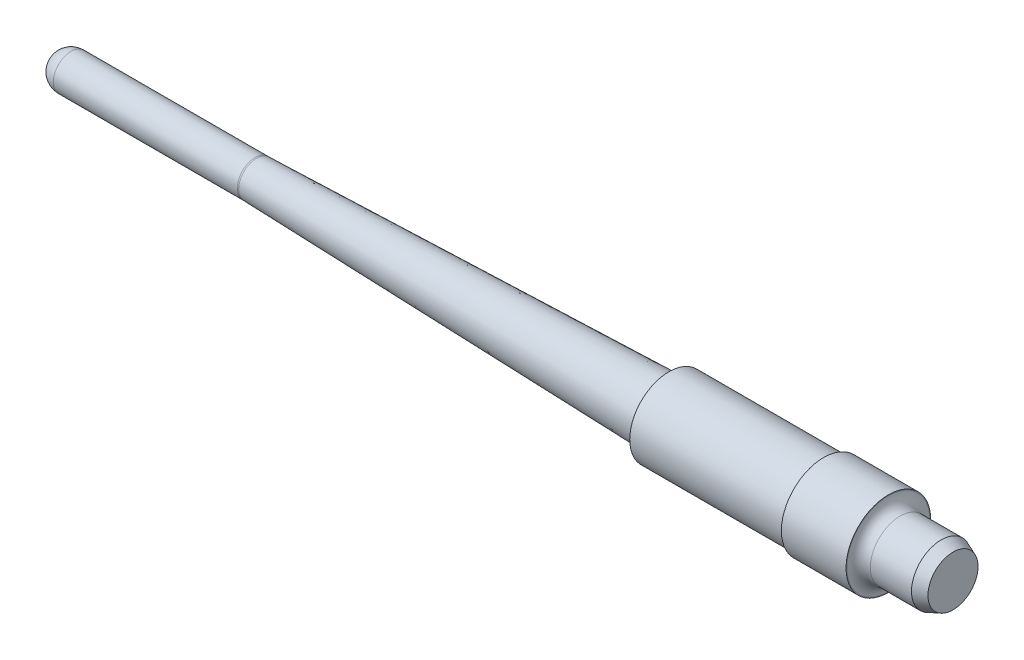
from build123d import *


with BuildPart() as part:
    # Sketch1 → Revolve1 (revolve)
    with BuildSketch(Plane.XY, mode=Mode.PRIVATE) as revolve1_sk:
        with BuildLine():
            Line((0, 1.1557), (11.9253, 1.1557))
            ThreePointArc((11.9253, 1.1557), (11.971968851, 1.156043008), (12.018627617, 1.157071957))
            Line((12.018627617, 1.157071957), (38.377899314, 1.932225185))
            ThreePointArc((38.377899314, 1.932225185), (38.640038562, 2.047641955), (38.7477, 2.31306055))
            Line((38.7477, 2.31306055), (38.7477, 2.54))
            Line((38.7477, 2.54), (48.6664, 2.54))
            ThreePointArc((48.6664, 2.54), (48.747222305, 2.573477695), (48.7807, 2.6543))
            Line((48.7807, 2.6543), (48.7807, 2.7432))
            Line((48.7807, 2.7432), (52.9717, 2.7432))
            Line((52.9717, 2.7432), (52.9717, 2.6924))
            ThreePointArc((52.9717, 2.6924), (53.194884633, 2.153584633), (53.7337, 1.9304))
            Line((53.7337, 1.9304), (56.4007, 1.9304))
            Line((56.4007, 1.9304), (57.1627, 1.622532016))
            Line((57.1627, 1.622532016), (57.1627, 0))
            Line((57.1627, 0), (-1.1557, 0))
            ThreePointArc((-1.1557, 0), (-0.817203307, 0.817203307), (0, 1.1557))
        make_face()
    revolve(revolve1_sk.sketch.rotate(Axis((0, 0, 0), (1, 0, 0)), 90), axis=Axis((0, 0, 0), (1, 0, 0)))


solid = part.part
